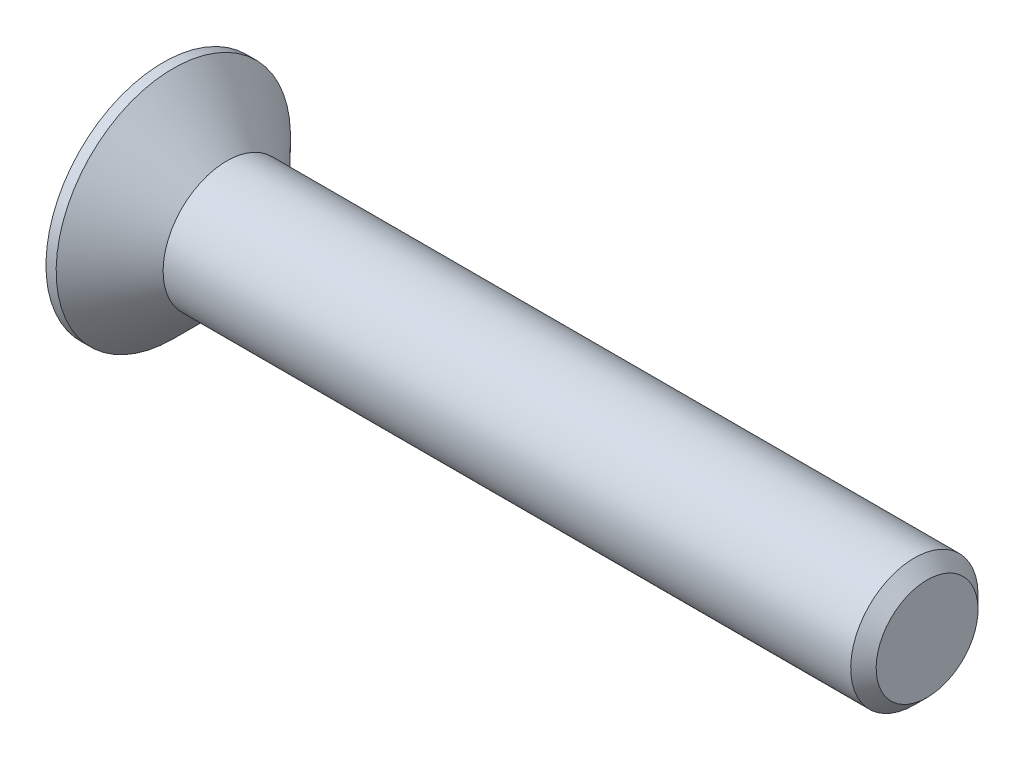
from build123d import *

# Parameters (mm, degrees)
CHAMFER1_SIZE      = 0.5
CUT_EXTRUDE1_DEPTH = 2.1


with BuildPart() as part:
    # Sketch1 → Revolve1 (revolve)
    with BuildSketch(Plane.XY, mode=Mode.PRIVATE) as revolve1_sk:
        Polygon((-2.5, 4.6), (-2.5, 0), (27.5, 0), (27.5, 2.5), (0, 2.5), (-2.1, 4.6), align=None)
    revolve(revolve1_sk.sketch.rotate(Axis((-2.5, 0, 0), (1, 0, 0)), 180), axis=Axis((-2.5, 0, 0), (1, 0, 0)))

    # Chamfer1
    chamfer1_edges = [part.edges().sort_by_distance(p)[0] for p in [
        (27.5, 2.5, 0),
    ]]
    chamfer(chamfer1_edges, length=CHAMFER1_SIZE)

    # Sketch2 → Cut-Extrude1 (cut)
    with BuildSketch(Plane.ZY.offset(2.5)):
        Polygon((-0.575, 2.3), (0.575, 2.3), (0.575, 0.575), (2.3, 0.575), (2.3, -0.575), (0.575, -0.575), (0.575, -2.3), (-0.575, -2.3), (-0.575, -0.575), (-2.3, -0.575), (-2.3, 0.575), (-0.575, 0.575), align=None)
    extrude(amount=-CUT_EXTRUDE1_DEPTH, mode=Mode.SUBTRACT)


solid = part.part
